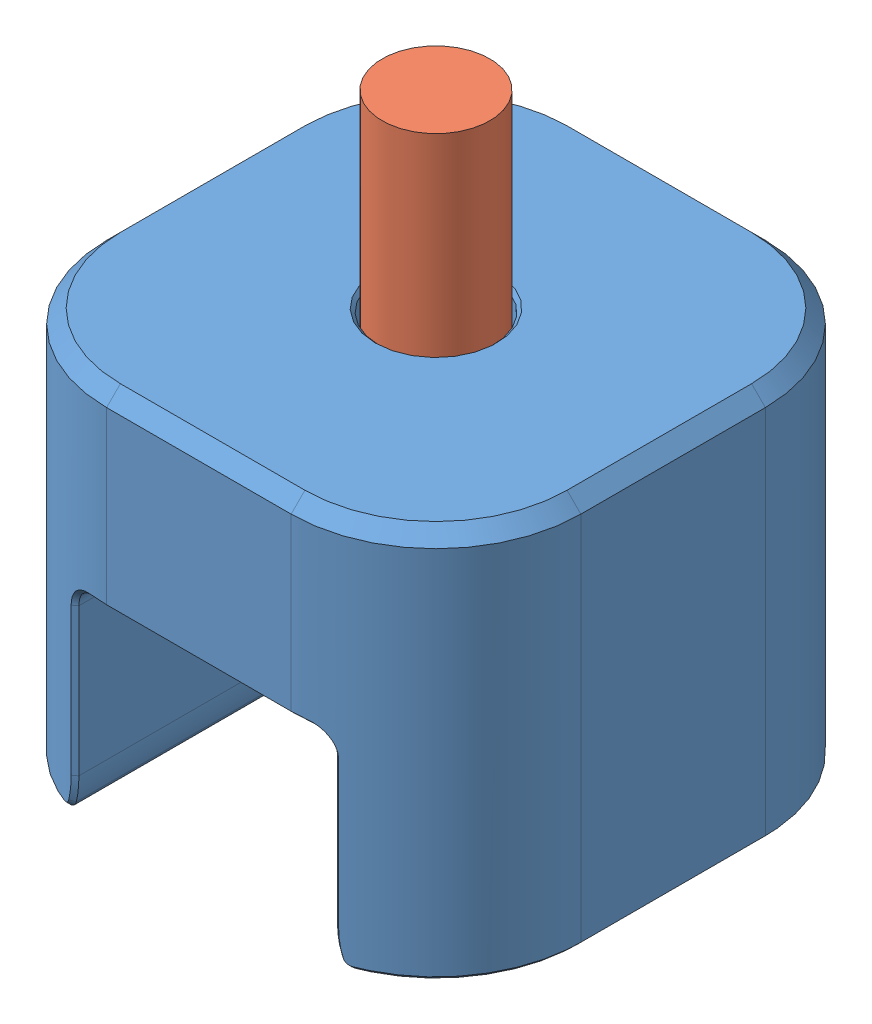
SolidWorks assembly TL137X137 FEMALE HALF.SLDASM, configuration Default (file format 13000). Lengths in mm.
Overall size (34.93 42.49 34.93).
2 component instances, 2 part files, 1 mates.
Components (placement in the parent):
- TL137X137-F-1: TL137X137-F.SLDPRT [Default] at origin size (34.93 28.58 34.93)
- SHCS31-18L.75-1: SHCS31-18L.75.sldprt [SHCS31-18L.75] at (0 23.4442 0) x (0.954024 0 -0.299732) z (0 1 0) size (11.89 11.89 26.97)
Mates (geometry in assembly coordinates):
- ProfileCenter1: profile center: circle of SHCS31-18L.75-1; plane of TL137X137-F-1 through (4.1783 23.4442 0) normal (0 -1 0)
